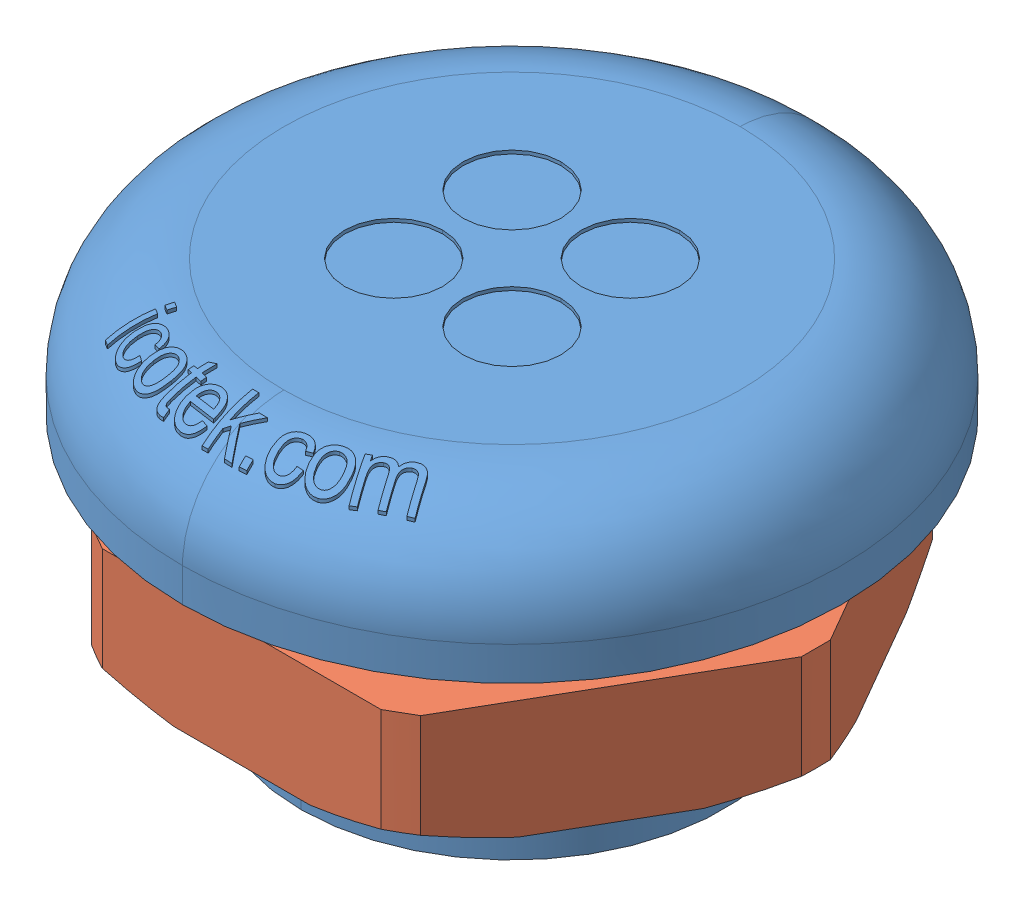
SolidWorks assembly 70346.SLDASM, configuration Default (file format 8000). Lengths in mm.
Overall size (39 22.12 39).
2 component instances, 2 part files, 0 mates.
Components (placement in the parent):
- 70346_01-1: 70346_01.SLDPRT [Default] at origin size (39 22.12 39)
- 70346_02-1: 70346_02.SLDPRT [Default] at origin size (36 7 34.92)
